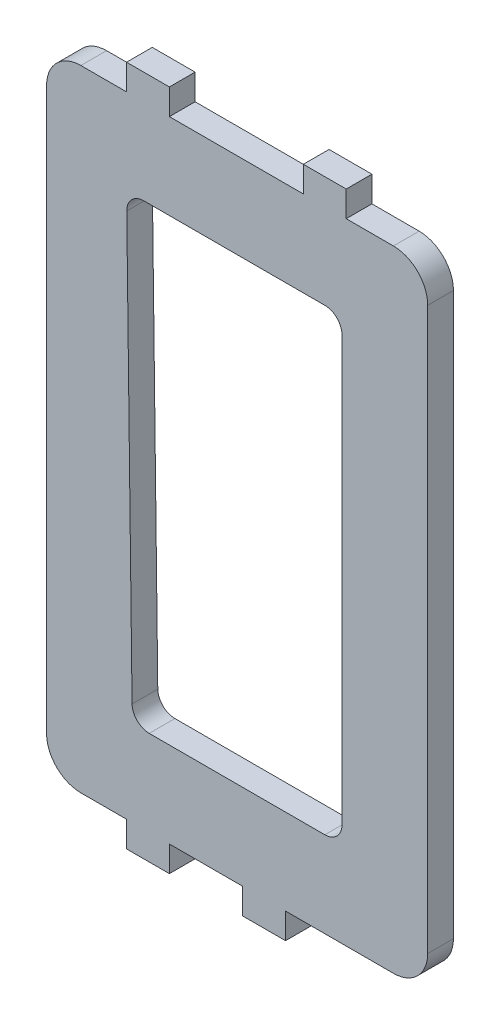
ISO-10303-21;
HEADER;
FILE_DESCRIPTION(('STEP AP214'),'2;1');
FILE_NAME('part.step','',(''),(''),'','','');
FILE_SCHEMA(('AUTOMOTIVE_DESIGN { 1 0 10303 214 1 1 1 1 }'));
ENDSEC;
DATA;
#1=APPLICATION_CONTEXT('core data for automotive mechanical design processes');
#2=APPLICATION_PROTOCOL_DEFINITION('international standard','automotive_design',2000,#1);
#3=PRODUCT_CONTEXT('',#1,'mechanical');
#4=PRODUCT('Part','Part','',(#3));
#5=PRODUCT_RELATED_PRODUCT_CATEGORY('part','',(#4));
#6=PRODUCT_DEFINITION_FORMATION('','',#4);
#7=PRODUCT_DEFINITION_CONTEXT('part definition',#1,'design');
#8=PRODUCT_DEFINITION('design','',#6,#7);
#9=PRODUCT_DEFINITION_SHAPE('','',#8);
#10=(LENGTH_UNIT() NAMED_UNIT(*) SI_UNIT(.MILLI.,.METRE.));
#11=(NAMED_UNIT(*) PLANE_ANGLE_UNIT() SI_UNIT($,.RADIAN.));
#12=(NAMED_UNIT(*) SI_UNIT($,.STERADIAN.) SOLID_ANGLE_UNIT());
#13=UNCERTAINTY_MEASURE_WITH_UNIT(LENGTH_MEASURE(1.E-05),#10,'distance_accuracy_value','');
#14=(GEOMETRIC_REPRESENTATION_CONTEXT(3) GLOBAL_UNCERTAINTY_ASSIGNED_CONTEXT((#13)) GLOBAL_UNIT_ASSIGNED_CONTEXT((#10,
#11,#12)) REPRESENTATION_CONTEXT('',''));
#15=CARTESIAN_POINT('',(0.,0.,0.));
#16=DIRECTION('',(0.,0.,1.));
#17=DIRECTION('',(1.,0.,0.));
#18=AXIS2_PLACEMENT_3D('',#15,#16,#17);
#19=CARTESIAN_POINT('',(-53.6952118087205,-16.8541333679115,3.));
#20=DIRECTION('',(0.,0.,-1.));
#21=DIRECTION('',(-1.,0.,0.));
#22=AXIS2_PLACEMENT_3D('',#19,#20,#21);
#23=PLANE('',#22);
#24=DIRECTION('',(1.,0.,0.));
#25=VECTOR('',#24,1.);
#26=CARTESIAN_POINT('',(-48.3652118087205,-20.8541333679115,3.));
#27=LINE('',#26,#25);
#28=CARTESIAN_POINT('',(-53.6952118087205,-20.8541333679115,3.));
#29=VERTEX_POINT('',#28);
#30=CARTESIAN_POINT('',(-48.3652118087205,-20.8541333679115,3.));
#31=VERTEX_POINT('',#30);
#32=EDGE_CURVE('E306',#29,#31,#27,.T.);
#33=ORIENTED_EDGE('',*,*,#32,.T.);
#34=DIRECTION('',(0.,-1.,0.));
#35=VECTOR('',#34,1.);
#36=CARTESIAN_POINT('',(-48.3652118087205,-20.8541333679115,3.));
#37=LINE('',#36,#35);
#38=CARTESIAN_POINT('',(-48.3652118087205,-23.8541333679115,3.));
#39=VERTEX_POINT('',#38);
#40=EDGE_CURVE('E309',#31,#39,#37,.T.);
#41=ORIENTED_EDGE('',*,*,#40,.T.);
#42=DIRECTION('',(1.,0.,0.));
#43=VECTOR('',#42,1.);
#44=CARTESIAN_POINT('',(-48.3652118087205,-23.8541333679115,3.));
#45=LINE('',#44,#43);
#46=CARTESIAN_POINT('',(-43.3652118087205,-23.8541333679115,3.));
#47=VERTEX_POINT('',#46);
#48=EDGE_CURVE('E312',#39,#47,#45,.T.);
#49=ORIENTED_EDGE('',*,*,#48,.T.);
#50=DIRECTION('',(0.,1.,0.));
#51=VECTOR('',#50,1.);
#52=CARTESIAN_POINT('',(-43.3652118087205,-23.8541333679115,3.));
#53=LINE('',#52,#51);
#54=CARTESIAN_POINT('',(-43.3652118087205,-20.8541333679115,3.));
#55=VERTEX_POINT('',#54);
#56=EDGE_CURVE('E314',#47,#55,#53,.T.);
#57=ORIENTED_EDGE('',*,*,#56,.T.);
#58=DIRECTION('',(1.,0.,0.));
#59=VECTOR('',#58,1.);
#60=CARTESIAN_POINT('',(-34.8152118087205,-20.8541333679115,3.));
#61=LINE('',#60,#59);
#62=CARTESIAN_POINT('',(-34.8152118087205,-20.8541333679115,3.));
#63=VERTEX_POINT('',#62);
#64=EDGE_CURVE('E316',#55,#63,#61,.T.);
#65=ORIENTED_EDGE('',*,*,#64,.T.);
#66=DIRECTION('',(0.,-1.,0.));
#67=VECTOR('',#66,1.);
#68=CARTESIAN_POINT('',(-34.8152118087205,-23.8541333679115,3.));
#69=LINE('',#68,#67);
#70=CARTESIAN_POINT('',(-34.8152118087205,-23.8541333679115,3.));
#71=VERTEX_POINT('',#70);
#72=EDGE_CURVE('E318',#63,#71,#69,.T.);
#73=ORIENTED_EDGE('',*,*,#72,.T.);
#74=DIRECTION('',(1.,0.,0.));
#75=VECTOR('',#74,1.);
#76=CARTESIAN_POINT('',(-34.8152118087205,-23.8541333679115,3.));
#77=LINE('',#76,#75);
#78=CARTESIAN_POINT('',(-29.8152118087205,-23.8541333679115,3.));
#79=VERTEX_POINT('',#78);
#80=EDGE_CURVE('E320',#71,#79,#77,.T.);
#81=ORIENTED_EDGE('',*,*,#80,.T.);
#82=DIRECTION('',(0.,1.,0.));
#83=VECTOR('',#82,1.);
#84=CARTESIAN_POINT('',(-29.8152118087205,-23.8541333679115,3.));
#85=LINE('',#84,#83);
#86=CARTESIAN_POINT('',(-29.8152118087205,-20.8541333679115,3.));
#87=VERTEX_POINT('',#86);
#88=EDGE_CURVE('E322',#79,#87,#85,.T.);
#89=ORIENTED_EDGE('',*,*,#88,.T.);
#90=DIRECTION('',(1.,0.,0.));
#91=VECTOR('',#90,1.);
#92=CARTESIAN_POINT('',(-29.8152118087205,-20.8541333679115,3.));
#93=LINE('',#92,#91);
#94=CARTESIAN_POINT('',(-17.2252118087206,-20.8541333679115,3.));
#95=VERTEX_POINT('',#94);
#96=EDGE_CURVE('E324',#87,#95,#93,.T.);
#97=ORIENTED_EDGE('',*,*,#96,.T.);
#98=CARTESIAN_POINT('',(-17.2252118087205,-16.8541333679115,3.));
#99=DIRECTION('',(0.,0.,1.));
#100=DIRECTION('',(-1.,0.,0.));
#101=AXIS2_PLACEMENT_3D('',#98,#99,#100);
#102=CIRCLE('',#101,4.);
#103=CARTESIAN_POINT('',(-13.2252118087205,-16.8541333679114,3.));
#104=VERTEX_POINT('',#103);
#105=EDGE_CURVE('E326',#95,#104,#102,.T.);
#106=ORIENTED_EDGE('',*,*,#105,.T.);
#107=DIRECTION('',(0.,1.,0.));
#108=VECTOR('',#107,1.);
#109=CARTESIAN_POINT('',(-13.2252118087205,48.6458666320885,3.));
#110=LINE('',#109,#108);
#111=CARTESIAN_POINT('',(-13.2252118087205,48.6458666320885,3.));
#112=VERTEX_POINT('',#111);
#113=EDGE_CURVE('E328',#104,#112,#110,.T.);
#114=ORIENTED_EDGE('',*,*,#113,.T.);
#115=CARTESIAN_POINT('',(-17.2252118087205,48.6458666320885,3.));
#116=DIRECTION('',(0.,0.,1.));
#117=DIRECTION('',(-1.,0.,0.));
#118=AXIS2_PLACEMENT_3D('',#115,#116,#117);
#119=CIRCLE('',#118,4.);
#120=CARTESIAN_POINT('',(-17.2252118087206,52.6458666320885,3.));
#121=VERTEX_POINT('',#120);
#122=EDGE_CURVE('E330',#112,#121,#119,.T.);
#123=ORIENTED_EDGE('',*,*,#122,.T.);
#124=DIRECTION('',(-1.,0.,0.));
#125=VECTOR('',#124,1.);
#126=CARTESIAN_POINT('',(-22.7352118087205,52.6458666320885,3.));
#127=LINE('',#126,#125);
#128=CARTESIAN_POINT('',(-22.7352118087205,52.6458666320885,3.));
#129=VERTEX_POINT('',#128);
#130=EDGE_CURVE('E332',#121,#129,#127,.T.);
#131=ORIENTED_EDGE('',*,*,#130,.T.);
#132=DIRECTION('',(0.,1.,0.));
#133=VECTOR('',#132,1.);
#134=CARTESIAN_POINT('',(-22.7352118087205,55.6458666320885,3.));
#135=LINE('',#134,#133);
#136=CARTESIAN_POINT('',(-22.7352118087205,55.6458666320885,3.));
#137=VERTEX_POINT('',#136);
#138=EDGE_CURVE('E334',#129,#137,#135,.T.);
#139=ORIENTED_EDGE('',*,*,#138,.T.);
#140=DIRECTION('',(-1.,0.,0.));
#141=VECTOR('',#140,1.);
#142=CARTESIAN_POINT('',(-27.7352118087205,55.6458666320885,3.));
#143=LINE('',#142,#141);
#144=CARTESIAN_POINT('',(-27.7352118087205,55.6458666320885,3.));
#145=VERTEX_POINT('',#144);
#146=EDGE_CURVE('E336',#137,#145,#143,.T.);
#147=ORIENTED_EDGE('',*,*,#146,.T.);
#148=DIRECTION('',(0.,-1.,0.));
#149=VECTOR('',#148,1.);
#150=CARTESIAN_POINT('',(-27.7352118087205,55.6458666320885,3.));
#151=LINE('',#150,#149);
#152=CARTESIAN_POINT('',(-27.7352118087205,52.6458666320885,3.));
#153=VERTEX_POINT('',#152);
#154=EDGE_CURVE('E338',#145,#153,#151,.T.);
#155=ORIENTED_EDGE('',*,*,#154,.T.);
#156=DIRECTION('',(-1.,0.,0.));
#157=VECTOR('',#156,1.);
#158=CARTESIAN_POINT('',(-27.7352118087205,52.6458666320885,3.));
#159=LINE('',#158,#157);
#160=CARTESIAN_POINT('',(-43.3652118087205,52.6458666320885,3.));
#161=VERTEX_POINT('',#160);
#162=EDGE_CURVE('E340',#153,#161,#159,.T.);
#163=ORIENTED_EDGE('',*,*,#162,.T.);
#164=DIRECTION('',(0.,1.,0.));
#165=VECTOR('',#164,1.);
#166=CARTESIAN_POINT('',(-43.3652118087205,55.6458666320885,3.));
#167=LINE('',#166,#165);
#168=CARTESIAN_POINT('',(-43.3652118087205,55.6458666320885,3.));
#169=VERTEX_POINT('',#168);
#170=EDGE_CURVE('E342',#161,#169,#167,.T.);
#171=ORIENTED_EDGE('',*,*,#170,.T.);
#172=DIRECTION('',(-1.,0.,0.));
#173=VECTOR('',#172,1.);
#174=CARTESIAN_POINT('',(-48.3652118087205,55.6458666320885,3.));
#175=LINE('',#174,#173);
#176=CARTESIAN_POINT('',(-48.3652118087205,55.6458666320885,3.));
#177=VERTEX_POINT('',#176);
#178=EDGE_CURVE('E344',#169,#177,#175,.T.);
#179=ORIENTED_EDGE('',*,*,#178,.T.);
#180=DIRECTION('',(0.,-1.,0.));
#181=VECTOR('',#180,1.);
#182=CARTESIAN_POINT('',(-48.3652118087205,52.6458666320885,3.));
#183=LINE('',#182,#181);
#184=CARTESIAN_POINT('',(-48.3652118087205,52.6458666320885,3.));
#185=VERTEX_POINT('',#184);
#186=EDGE_CURVE('E346',#177,#185,#183,.T.);
#187=ORIENTED_EDGE('',*,*,#186,.T.);
#188=DIRECTION('',(-1.,0.,0.));
#189=VECTOR('',#188,1.);
#190=CARTESIAN_POINT('',(-53.6952118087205,52.6458666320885,3.));
#191=LINE('',#190,#189);
#192=CARTESIAN_POINT('',(-53.6952118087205,52.6458666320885,3.));
#193=VERTEX_POINT('',#192);
#194=EDGE_CURVE('E348',#185,#193,#191,.T.);
#195=ORIENTED_EDGE('',*,*,#194,.T.);
#196=CARTESIAN_POINT('',(-53.6952118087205,48.6458666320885,3.));
#197=DIRECTION('',(0.,0.,1.));
#198=DIRECTION('',(-1.,0.,0.));
#199=AXIS2_PLACEMENT_3D('',#196,#197,#198);
#200=CIRCLE('',#199,4.);
#201=CARTESIAN_POINT('',(-57.6952118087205,48.6458666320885,3.));
#202=VERTEX_POINT('',#201);
#203=EDGE_CURVE('E350',#193,#202,#200,.T.);
#204=ORIENTED_EDGE('',*,*,#203,.T.);
#205=DIRECTION('',(0.,-1.,0.));
#206=VECTOR('',#205,1.);
#207=CARTESIAN_POINT('',(-57.6952118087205,48.6458666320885,3.));
#208=LINE('',#207,#206);
#209=CARTESIAN_POINT('',(-57.6952118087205,-16.8541333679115,3.));
#210=VERTEX_POINT('',#209);
#211=EDGE_CURVE('E352',#202,#210,#208,.T.);
#212=ORIENTED_EDGE('',*,*,#211,.T.);
#213=CARTESIAN_POINT('',(-53.6952118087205,-16.8541333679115,3.));
#214=DIRECTION('',(0.,0.,1.));
#215=DIRECTION('',(-1.,0.,0.));
#216=AXIS2_PLACEMENT_3D('',#213,#214,#215);
#217=CIRCLE('',#216,4.);
#218=EDGE_CURVE('E354',#210,#29,#217,.T.);
#219=ORIENTED_EDGE('',*,*,#218,.T.);
#220=EDGE_LOOP('',(#33,#41,#49,#57,#65,#73,#81,#89,#97,#106,#114,#123,#131,#139,#147,#155,#163,
#171,#179,#187,#195,#204,#212,#219));
#221=FACE_BOUND('',#220,.T.);
#222=CARTESIAN_POINT('',(-46.3400082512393,40.6458666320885,3.));
#223=DIRECTION('',(0.,0.,1.));
#224=DIRECTION('',(-1.,0.,0.));
#225=AXIS2_PLACEMENT_3D('',#222,#223,#224);
#226=CIRCLE('',#225,2.);
#227=CARTESIAN_POINT('',(-46.3400082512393,42.6458666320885,3.));
#228=VERTEX_POINT('',#227);
#229=CARTESIAN_POINT('',(-48.3398514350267,40.6208218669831,3.));
#230=VERTEX_POINT('',#229);
#231=EDGE_CURVE('E246',#228,#230,#226,.T.);
#232=ORIENTED_EDGE('',*,*,#231,.F.);
#233=DIRECTION('',(-1.,0.,0.));
#234=VECTOR('',#233,1.);
#235=CARTESIAN_POINT('',(-46.3400082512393,42.6458666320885,3.));
#236=LINE('',#235,#234);
#237=CARTESIAN_POINT('',(-25.2252118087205,42.6458666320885,3.));
#238=VERTEX_POINT('',#237);
#239=EDGE_CURVE('E241',#238,#228,#236,.T.);
#240=ORIENTED_EDGE('',*,*,#239,.F.);
#241=CARTESIAN_POINT('',(-25.2252118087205,40.6458666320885,3.));
#242=DIRECTION('',(0.,0.,1.));
#243=DIRECTION('',(-1.,0.,0.));
#244=AXIS2_PLACEMENT_3D('',#241,#242,#243);
#245=CIRCLE('',#244,2.);
#246=CARTESIAN_POINT('',(-23.2252118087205,40.6458666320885,3.));
#247=VERTEX_POINT('',#246);
#248=EDGE_CURVE('E272',#247,#238,#245,.T.);
#249=ORIENTED_EDGE('',*,*,#248,.F.);
#250=DIRECTION('',(0.,1.,0.));
#251=VECTOR('',#250,1.);
#252=CARTESIAN_POINT('',(-23.2252118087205,40.6458666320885,3.));
#253=LINE('',#252,#251);
#254=CARTESIAN_POINT('',(-23.2252118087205,-8.85413336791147,3.));
#255=VERTEX_POINT('',#254);
#256=EDGE_CURVE('E270',#255,#247,#253,.T.);
#257=ORIENTED_EDGE('',*,*,#256,.F.);
#258=CARTESIAN_POINT('',(-25.2252118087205,-8.85413336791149,3.));
#259=DIRECTION('',(0.,0.,1.));
#260=DIRECTION('',(-1.,0.,0.));
#261=AXIS2_PLACEMENT_3D('',#258,#259,#260);
#262=CIRCLE('',#261,2.);
#263=CARTESIAN_POINT('',(-25.2252118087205,-10.8541333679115,3.));
#264=VERTEX_POINT('',#263);
#265=EDGE_CURVE('E268',#264,#255,#262,.T.);
#266=ORIENTED_EDGE('',*,*,#265,.F.);
#267=DIRECTION('',(1.,0.,0.));
#268=VECTOR('',#267,1.);
#269=CARTESIAN_POINT('',(-25.2252118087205,-10.8541333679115,3.));
#270=LINE('',#269,#268);
#271=CARTESIAN_POINT('',(-45.7201017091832,-10.8541333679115,3.));
#272=VERTEX_POINT('',#271);
#273=EDGE_CURVE('E266',#272,#264,#270,.T.);
#274=ORIENTED_EDGE('',*,*,#273,.F.);
#275=CARTESIAN_POINT('',(-45.7201017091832,-8.85413336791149,3.));
#276=DIRECTION('',(0.,0.,1.));
#277=DIRECTION('',(-1.,0.,0.));
#278=AXIS2_PLACEMENT_3D('',#275,#276,#277);
#279=CIRCLE('',#278,2.);
#280=CARTESIAN_POINT('',(-47.7199448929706,-8.87917813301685,3.));
#281=VERTEX_POINT('',#280);
#282=EDGE_CURVE('E262',#281,#272,#279,.T.);
#283=ORIENTED_EDGE('',*,*,#282,.F.);
#284=DIRECTION('',(0.0125223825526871,-0.999921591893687,0.));
#285=VECTOR('',#284,1.);
#286=CARTESIAN_POINT('',(-47.7199448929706,-8.87917813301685,3.));
#287=LINE('',#286,#285);
#288=EDGE_CURVE('E260',#230,#281,#287,.T.);
#289=ORIENTED_EDGE('',*,*,#288,.F.);
#290=EDGE_LOOP('',(#232,#240,#249,#257,#266,#274,#283,#289));
#291=FACE_BOUND('',#290,.T.);
#292=ADVANCED_FACE('F35',(#221,#291),#23,.F.);
#293=CARTESIAN_POINT('',(-53.6952118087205,-16.8541333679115,0.));
#294=DIRECTION('',(0.,0.,-1.));
#295=DIRECTION('',(-1.,0.,0.));
#296=AXIS2_PLACEMENT_3D('',#293,#294,#295);
#297=PLANE('',#296);
#298=DIRECTION('',(1.,0.,0.));
#299=VECTOR('',#298,1.);
#300=CARTESIAN_POINT('',(-48.3652118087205,-20.8541333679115,0.));
#301=LINE('',#300,#299);
#302=CARTESIAN_POINT('',(-53.6952118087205,-20.8541333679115,0.));
#303=VERTEX_POINT('',#302);
#304=CARTESIAN_POINT('',(-48.3652118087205,-20.8541333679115,0.));
#305=VERTEX_POINT('',#304);
#306=EDGE_CURVE('E255',#303,#305,#301,.T.);
#307=ORIENTED_EDGE('',*,*,#306,.F.);
#308=CARTESIAN_POINT('',(-53.6952118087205,-16.8541333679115,0.));
#309=DIRECTION('',(0.,0.,1.));
#310=DIRECTION('',(-1.,0.,0.));
#311=AXIS2_PLACEMENT_3D('',#308,#309,#310);
#312=CIRCLE('',#311,4.);
#313=CARTESIAN_POINT('',(-57.6952118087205,-16.8541333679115,0.));
#314=VERTEX_POINT('',#313);
#315=EDGE_CURVE('E310',#314,#303,#312,.T.);
#316=ORIENTED_EDGE('',*,*,#315,.F.);
#317=DIRECTION('',(0.,-1.,0.));
#318=VECTOR('',#317,1.);
#319=CARTESIAN_POINT('',(-57.6952118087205,48.6458666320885,0.));
#320=LINE('',#319,#318);
#321=CARTESIAN_POINT('',(-57.6952118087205,48.6458666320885,0.));
#322=VERTEX_POINT('',#321);
#323=EDGE_CURVE('E401',#322,#314,#320,.T.);
#324=ORIENTED_EDGE('',*,*,#323,.F.);
#325=CARTESIAN_POINT('',(-53.6952118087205,48.6458666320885,0.));
#326=DIRECTION('',(0.,0.,1.));
#327=DIRECTION('',(-1.,0.,0.));
#328=AXIS2_PLACEMENT_3D('',#325,#326,#327);
#329=CIRCLE('',#328,4.);
#330=CARTESIAN_POINT('',(-53.6952118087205,52.6458666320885,0.));
#331=VERTEX_POINT('',#330);
#332=EDGE_CURVE('E399',#331,#322,#329,.T.);
#333=ORIENTED_EDGE('',*,*,#332,.F.);
#334=DIRECTION('',(-1.,0.,0.));
#335=VECTOR('',#334,1.);
#336=CARTESIAN_POINT('',(-53.6952118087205,52.6458666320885,0.));
#337=LINE('',#336,#335);
#338=CARTESIAN_POINT('',(-48.3652118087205,52.6458666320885,0.));
#339=VERTEX_POINT('',#338);
#340=EDGE_CURVE('E397',#339,#331,#337,.T.);
#341=ORIENTED_EDGE('',*,*,#340,.F.);
#342=DIRECTION('',(0.,-1.,0.));
#343=VECTOR('',#342,1.);
#344=CARTESIAN_POINT('',(-48.3652118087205,52.6458666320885,0.));
#345=LINE('',#344,#343);
#346=CARTESIAN_POINT('',(-48.3652118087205,55.6458666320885,0.));
#347=VERTEX_POINT('',#346);
#348=EDGE_CURVE('E395',#347,#339,#345,.T.);
#349=ORIENTED_EDGE('',*,*,#348,.F.);
#350=DIRECTION('',(-1.,0.,0.));
#351=VECTOR('',#350,1.);
#352=CARTESIAN_POINT('',(-48.3652118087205,55.6458666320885,0.));
#353=LINE('',#352,#351);
#354=CARTESIAN_POINT('',(-43.3652118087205,55.6458666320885,0.));
#355=VERTEX_POINT('',#354);
#356=EDGE_CURVE('E393',#355,#347,#353,.T.);
#357=ORIENTED_EDGE('',*,*,#356,.F.);
#358=DIRECTION('',(0.,1.,0.));
#359=VECTOR('',#358,1.);
#360=CARTESIAN_POINT('',(-43.3652118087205,55.6458666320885,0.));
#361=LINE('',#360,#359);
#362=CARTESIAN_POINT('',(-43.3652118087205,52.6458666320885,0.));
#363=VERTEX_POINT('',#362);
#364=EDGE_CURVE('E391',#363,#355,#361,.T.);
#365=ORIENTED_EDGE('',*,*,#364,.F.);
#366=DIRECTION('',(-1.,0.,0.));
#367=VECTOR('',#366,1.);
#368=CARTESIAN_POINT('',(-27.7352118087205,52.6458666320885,0.));
#369=LINE('',#368,#367);
#370=CARTESIAN_POINT('',(-27.7352118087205,52.6458666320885,0.));
#371=VERTEX_POINT('',#370);
#372=EDGE_CURVE('E389',#371,#363,#369,.T.);
#373=ORIENTED_EDGE('',*,*,#372,.F.);
#374=DIRECTION('',(0.,-1.,0.));
#375=VECTOR('',#374,1.);
#376=CARTESIAN_POINT('',(-27.7352118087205,55.6458666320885,0.));
#377=LINE('',#376,#375);
#378=CARTESIAN_POINT('',(-27.7352118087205,55.6458666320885,0.));
#379=VERTEX_POINT('',#378);
#380=EDGE_CURVE('E387',#379,#371,#377,.T.);
#381=ORIENTED_EDGE('',*,*,#380,.F.);
#382=DIRECTION('',(-1.,0.,0.));
#383=VECTOR('',#382,1.);
#384=CARTESIAN_POINT('',(-27.7352118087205,55.6458666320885,0.));
#385=LINE('',#384,#383);
#386=CARTESIAN_POINT('',(-22.7352118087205,55.6458666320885,0.));
#387=VERTEX_POINT('',#386);
#388=EDGE_CURVE('E385',#387,#379,#385,.T.);
#389=ORIENTED_EDGE('',*,*,#388,.F.);
#390=DIRECTION('',(0.,1.,0.));
#391=VECTOR('',#390,1.);
#392=CARTESIAN_POINT('',(-22.7352118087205,55.6458666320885,0.));
#393=LINE('',#392,#391);
#394=CARTESIAN_POINT('',(-22.7352118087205,52.6458666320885,0.));
#395=VERTEX_POINT('',#394);
#396=EDGE_CURVE('E383',#395,#387,#393,.T.);
#397=ORIENTED_EDGE('',*,*,#396,.F.);
#398=DIRECTION('',(-1.,0.,0.));
#399=VECTOR('',#398,1.);
#400=CARTESIAN_POINT('',(-22.7352118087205,52.6458666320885,0.));
#401=LINE('',#400,#399);
#402=CARTESIAN_POINT('',(-17.2252118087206,52.6458666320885,0.));
#403=VERTEX_POINT('',#402);
#404=EDGE_CURVE('E381',#403,#395,#401,.T.);
#405=ORIENTED_EDGE('',*,*,#404,.F.);
#406=CARTESIAN_POINT('',(-17.2252118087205,48.6458666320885,0.));
#407=DIRECTION('',(0.,0.,1.));
#408=DIRECTION('',(-1.,0.,0.));
#409=AXIS2_PLACEMENT_3D('',#406,#407,#408);
#410=CIRCLE('',#409,4.);
#411=CARTESIAN_POINT('',(-13.2252118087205,48.6458666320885,0.));
#412=VERTEX_POINT('',#411);
#413=EDGE_CURVE('E379',#412,#403,#410,.T.);
#414=ORIENTED_EDGE('',*,*,#413,.F.);
#415=DIRECTION('',(0.,1.,0.));
#416=VECTOR('',#415,1.);
#417=CARTESIAN_POINT('',(-13.2252118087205,48.6458666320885,0.));
#418=LINE('',#417,#416);
#419=CARTESIAN_POINT('',(-13.2252118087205,-16.8541333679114,0.));
#420=VERTEX_POINT('',#419);
#421=EDGE_CURVE('E377',#420,#412,#418,.T.);
#422=ORIENTED_EDGE('',*,*,#421,.F.);
#423=CARTESIAN_POINT('',(-17.2252118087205,-16.8541333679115,0.));
#424=DIRECTION('',(0.,0.,1.));
#425=DIRECTION('',(-1.,0.,0.));
#426=AXIS2_PLACEMENT_3D('',#423,#424,#425);
#427=CIRCLE('',#426,4.);
#428=CARTESIAN_POINT('',(-17.2252118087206,-20.8541333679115,0.));
#429=VERTEX_POINT('',#428);
#430=EDGE_CURVE('E375',#429,#420,#427,.T.);
#431=ORIENTED_EDGE('',*,*,#430,.F.);
#432=DIRECTION('',(1.,0.,0.));
#433=VECTOR('',#432,1.);
#434=CARTESIAN_POINT('',(-29.8152118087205,-20.8541333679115,0.));
#435=LINE('',#434,#433);
#436=CARTESIAN_POINT('',(-29.8152118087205,-20.8541333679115,0.));
#437=VERTEX_POINT('',#436);
#438=EDGE_CURVE('E373',#437,#429,#435,.T.);
#439=ORIENTED_EDGE('',*,*,#438,.F.);
#440=DIRECTION('',(0.,1.,0.));
#441=VECTOR('',#440,1.);
#442=CARTESIAN_POINT('',(-29.8152118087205,-23.8541333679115,0.));
#443=LINE('',#442,#441);
#444=CARTESIAN_POINT('',(-29.8152118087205,-23.8541333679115,0.));
#445=VERTEX_POINT('',#444);
#446=EDGE_CURVE('E371',#445,#437,#443,.T.);
#447=ORIENTED_EDGE('',*,*,#446,.F.);
#448=DIRECTION('',(1.,0.,0.));
#449=VECTOR('',#448,1.);
#450=CARTESIAN_POINT('',(-34.8152118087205,-23.8541333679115,0.));
#451=LINE('',#450,#449);
#452=CARTESIAN_POINT('',(-34.8152118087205,-23.8541333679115,0.));
#453=VERTEX_POINT('',#452);
#454=EDGE_CURVE('E369',#453,#445,#451,.T.);
#455=ORIENTED_EDGE('',*,*,#454,.F.);
#456=DIRECTION('',(0.,-1.,0.));
#457=VECTOR('',#456,1.);
#458=CARTESIAN_POINT('',(-34.8152118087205,-23.8541333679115,0.));
#459=LINE('',#458,#457);
#460=CARTESIAN_POINT('',(-34.8152118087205,-20.8541333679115,0.));
#461=VERTEX_POINT('',#460);
#462=EDGE_CURVE('E367',#461,#453,#459,.T.);
#463=ORIENTED_EDGE('',*,*,#462,.F.);
#464=DIRECTION('',(1.,0.,0.));
#465=VECTOR('',#464,1.);
#466=CARTESIAN_POINT('',(-34.8152118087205,-20.8541333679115,0.));
#467=LINE('',#466,#465);
#468=CARTESIAN_POINT('',(-43.3652118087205,-20.8541333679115,0.));
#469=VERTEX_POINT('',#468);
#470=EDGE_CURVE('E365',#469,#461,#467,.T.);
#471=ORIENTED_EDGE('',*,*,#470,.F.);
#472=DIRECTION('',(0.,1.,0.));
#473=VECTOR('',#472,1.);
#474=CARTESIAN_POINT('',(-43.3652118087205,-23.8541333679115,0.));
#475=LINE('',#474,#473);
#476=CARTESIAN_POINT('',(-43.3652118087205,-23.8541333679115,0.));
#477=VERTEX_POINT('',#476);
#478=EDGE_CURVE('E363',#477,#469,#475,.T.);
#479=ORIENTED_EDGE('',*,*,#478,.F.);
#480=DIRECTION('',(1.,0.,0.));
#481=VECTOR('',#480,1.);
#482=CARTESIAN_POINT('',(-48.3652118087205,-23.8541333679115,0.));
#483=LINE('',#482,#481);
#484=CARTESIAN_POINT('',(-48.3652118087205,-23.8541333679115,0.));
#485=VERTEX_POINT('',#484);
#486=EDGE_CURVE('E361',#485,#477,#483,.T.);
#487=ORIENTED_EDGE('',*,*,#486,.F.);
#488=DIRECTION('',(0.,-1.,0.));
#489=VECTOR('',#488,1.);
#490=CARTESIAN_POINT('',(-48.3652118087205,-20.8541333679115,0.));
#491=LINE('',#490,#489);
#492=EDGE_CURVE('E359',#305,#485,#491,.T.);
#493=ORIENTED_EDGE('',*,*,#492,.F.);
#494=EDGE_LOOP('',(#307,#316,#324,#333,#341,#349,#357,#365,#373,#381,#389,#397,#405,#414,#422,
#431,#439,#447,#455,#463,#471,#479,#487,#493));
#495=FACE_BOUND('',#494,.T.);
#496=DIRECTION('',(-1.,0.,0.));
#497=VECTOR('',#496,1.);
#498=CARTESIAN_POINT('',(-35.5502118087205,42.6458666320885,0.));
#499=LINE('',#498,#497);
#500=CARTESIAN_POINT('',(-25.2252118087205,42.6458666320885,0.));
#501=VERTEX_POINT('',#500);
#502=CARTESIAN_POINT('',(-46.3400082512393,42.6458666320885,0.));
#503=VERTEX_POINT('',#502);
#504=EDGE_CURVE('E247',#501,#503,#499,.T.);
#505=ORIENTED_EDGE('',*,*,#504,.T.);
#506=CARTESIAN_POINT('',(-46.3400082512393,40.6458666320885,0.));
#507=DIRECTION('',(0.,0.,1.));
#508=DIRECTION('',(-1.,0.,0.));
#509=AXIS2_PLACEMENT_3D('',#506,#507,#508);
#510=CIRCLE('',#509,2.);
#511=CARTESIAN_POINT('',(-48.3398514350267,40.6208218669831,0.));
#512=VERTEX_POINT('',#511);
#513=EDGE_CURVE('E253',#503,#512,#510,.T.);
#514=ORIENTED_EDGE('',*,*,#513,.T.);
#515=DIRECTION('',(0.0125223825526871,-0.999921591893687,0.));
#516=VECTOR('',#515,1.);
#517=CARTESIAN_POINT('',(-47.7199448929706,-8.87917813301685,0.));
#518=LINE('',#517,#516);
#519=CARTESIAN_POINT('',(-47.7199448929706,-8.87917813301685,0.));
#520=VERTEX_POINT('',#519);
#521=EDGE_CURVE('E275',#512,#520,#518,.T.);
#522=ORIENTED_EDGE('',*,*,#521,.T.);
#523=CARTESIAN_POINT('',(-45.7201017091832,-8.85413336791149,0.));
#524=DIRECTION('',(0.,0.,1.));
#525=DIRECTION('',(-1.,0.,0.));
#526=AXIS2_PLACEMENT_3D('',#523,#524,#525);
#527=CIRCLE('',#526,2.);
#528=CARTESIAN_POINT('',(-45.7201017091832,-10.8541333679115,0.));
#529=VERTEX_POINT('',#528);
#530=EDGE_CURVE('E278',#520,#529,#527,.T.);
#531=ORIENTED_EDGE('',*,*,#530,.T.);
#532=DIRECTION('',(1.,0.,0.));
#533=VECTOR('',#532,1.);
#534=CARTESIAN_POINT('',(-25.2252118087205,-10.8541333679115,0.));
#535=LINE('',#534,#533);
#536=CARTESIAN_POINT('',(-25.2252118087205,-10.8541333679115,0.));
#537=VERTEX_POINT('',#536);
#538=EDGE_CURVE('E281',#529,#537,#535,.T.);
#539=ORIENTED_EDGE('',*,*,#538,.T.);
#540=CARTESIAN_POINT('',(-25.2252118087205,-8.85413336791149,0.));
#541=DIRECTION('',(0.,0.,1.));
#542=DIRECTION('',(-1.,0.,0.));
#543=AXIS2_PLACEMENT_3D('',#540,#541,#542);
#544=CIRCLE('',#543,2.);
#545=CARTESIAN_POINT('',(-23.2252118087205,-8.85413336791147,0.));
#546=VERTEX_POINT('',#545);
#547=EDGE_CURVE('E284',#537,#546,#544,.T.);
#548=ORIENTED_EDGE('',*,*,#547,.T.);
#549=DIRECTION('',(0.,1.,0.));
#550=VECTOR('',#549,1.);
#551=CARTESIAN_POINT('',(-23.2252118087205,40.6458666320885,0.));
#552=LINE('',#551,#550);
#553=CARTESIAN_POINT('',(-23.2252118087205,40.6458666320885,0.));
#554=VERTEX_POINT('',#553);
#555=EDGE_CURVE('E287',#546,#554,#552,.T.);
#556=ORIENTED_EDGE('',*,*,#555,.T.);
#557=CARTESIAN_POINT('',(-25.2252118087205,40.6458666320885,0.));
#558=DIRECTION('',(0.,0.,1.));
#559=DIRECTION('',(-1.,0.,0.));
#560=AXIS2_PLACEMENT_3D('',#557,#558,#559);
#561=CIRCLE('',#560,2.);
#562=EDGE_CURVE('E290',#554,#501,#561,.T.);
#563=ORIENTED_EDGE('',*,*,#562,.T.);
#564=EDGE_LOOP('',(#505,#514,#522,#531,#539,#548,#556,#563));
#565=FACE_BOUND('',#564,.T.);
#566=ADVANCED_FACE('F479',(#495,#565),#297,.T.);
#567=CARTESIAN_POINT('',(-48.3652118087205,-20.8541333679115,3.));
#568=DIRECTION('',(0.,1.,0.));
#569=DIRECTION('',(-1.,0.,0.));
#570=AXIS2_PLACEMENT_3D('',#567,#568,#569);
#571=PLANE('',#570);
#572=ORIENTED_EDGE('',*,*,#306,.T.);
#573=DIRECTION('',(0.,0.,-1.));
#574=VECTOR('',#573,1.);
#575=CARTESIAN_POINT('',(-48.3652118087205,-20.8541333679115,3.));
#576=LINE('',#575,#574);
#577=EDGE_CURVE('E11',#31,#305,#576,.T.);
#578=ORIENTED_EDGE('',*,*,#577,.F.);
#579=ORIENTED_EDGE('',*,*,#32,.F.);
#580=DIRECTION('',(0.,0.,-1.));
#581=VECTOR('',#580,1.);
#582=CARTESIAN_POINT('',(-53.6952118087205,-20.8541333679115,3.));
#583=LINE('',#582,#581);
#584=EDGE_CURVE('E356',#29,#303,#583,.T.);
#585=ORIENTED_EDGE('',*,*,#584,.T.);
#586=EDGE_LOOP('',(#572,#578,#579,#585));
#587=FACE_BOUND('',#586,.T.);
#588=ADVANCED_FACE('F37',(#587),#571,.F.);
#589=CARTESIAN_POINT('',(-48.3652118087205,-20.8541333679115,3.));
#590=DIRECTION('',(1.,0.,0.));
#591=DIRECTION('',(0.,0.,-1.));
#592=AXIS2_PLACEMENT_3D('',#589,#590,#591);
#593=PLANE('',#592);
#594=ORIENTED_EDGE('',*,*,#492,.T.);
#595=DIRECTION('',(0.,0.,-1.));
#596=VECTOR('',#595,1.);
#597=CARTESIAN_POINT('',(-48.3652118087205,-23.8541333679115,3.));
#598=LINE('',#597,#596);
#599=EDGE_CURVE('E43',#39,#485,#598,.T.);
#600=ORIENTED_EDGE('',*,*,#599,.F.);
#601=ORIENTED_EDGE('',*,*,#40,.F.);
#602=ORIENTED_EDGE('',*,*,#577,.T.);
#603=EDGE_LOOP('',(#594,#600,#601,#602));
#604=FACE_BOUND('',#603,.T.);
#605=ADVANCED_FACE('F496',(#604),#593,.F.);
#606=CARTESIAN_POINT('',(-48.3652118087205,-23.8541333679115,3.));
#607=DIRECTION('',(0.,1.,0.));
#608=DIRECTION('',(0.,0.,1.));
#609=AXIS2_PLACEMENT_3D('',#606,#607,#608);
#610=PLANE('',#609);
#611=ORIENTED_EDGE('',*,*,#486,.T.);
#612=DIRECTION('',(0.,0.,-1.));
#613=VECTOR('',#612,1.);
#614=CARTESIAN_POINT('',(-43.3652118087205,-23.8541333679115,3.));
#615=LINE('',#614,#613);
#616=EDGE_CURVE('E466',#47,#477,#615,.T.);
#617=ORIENTED_EDGE('',*,*,#616,.F.);
#618=ORIENTED_EDGE('',*,*,#48,.F.);
#619=ORIENTED_EDGE('',*,*,#599,.T.);
#620=EDGE_LOOP('',(#611,#617,#618,#619));
#621=FACE_BOUND('',#620,.T.);
#622=ADVANCED_FACE('F473',(#621),#610,.F.);
#623=CARTESIAN_POINT('',(-43.3652118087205,-23.8541333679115,3.));
#624=DIRECTION('',(-1.,0.,0.));
#625=DIRECTION('',(0.,0.,1.));
#626=AXIS2_PLACEMENT_3D('',#623,#624,#625);
#627=PLANE('',#626);
#628=ORIENTED_EDGE('',*,*,#478,.T.);
#629=DIRECTION('',(0.,0.,-1.));
#630=VECTOR('',#629,1.);
#631=CARTESIAN_POINT('',(-43.3652118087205,-20.8541333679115,3.));
#632=LINE('',#631,#630);
#633=EDGE_CURVE('E463',#55,#469,#632,.T.);
#634=ORIENTED_EDGE('',*,*,#633,.F.);
#635=ORIENTED_EDGE('',*,*,#56,.F.);
#636=ORIENTED_EDGE('',*,*,#616,.T.);
#637=EDGE_LOOP('',(#628,#634,#635,#636));
#638=FACE_BOUND('',#637,.T.);
#639=ADVANCED_FACE('F485',(#638),#627,.F.);
#640=CARTESIAN_POINT('',(-34.8152118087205,-20.8541333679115,3.));
#641=DIRECTION('',(0.,1.,0.));
#642=DIRECTION('',(-1.,0.,0.));
#643=AXIS2_PLACEMENT_3D('',#640,#641,#642);
#644=PLANE('',#643);
#645=ORIENTED_EDGE('',*,*,#470,.T.);
#646=DIRECTION('',(0.,0.,-1.));
#647=VECTOR('',#646,1.);
#648=CARTESIAN_POINT('',(-34.8152118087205,-20.8541333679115,3.));
#649=LINE('',#648,#647);
#650=EDGE_CURVE('E460',#63,#461,#649,.T.);
#651=ORIENTED_EDGE('',*,*,#650,.F.);
#652=ORIENTED_EDGE('',*,*,#64,.F.);
#653=ORIENTED_EDGE('',*,*,#633,.T.);
#654=EDGE_LOOP('',(#645,#651,#652,#653));
#655=FACE_BOUND('',#654,.T.);
#656=ADVANCED_FACE('F489',(#655),#644,.F.);
#657=CARTESIAN_POINT('',(-34.8152118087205,-23.8541333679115,3.));
#658=DIRECTION('',(1.,0.,0.));
#659=DIRECTION('',(0.,1.,0.));
#660=AXIS2_PLACEMENT_3D('',#657,#658,#659);
#661=PLANE('',#660);
#662=ORIENTED_EDGE('',*,*,#462,.T.);
#663=DIRECTION('',(0.,0.,-1.));
#664=VECTOR('',#663,1.);
#665=CARTESIAN_POINT('',(-34.8152118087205,-23.8541333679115,3.));
#666=LINE('',#665,#664);
#667=EDGE_CURVE('E457',#71,#453,#666,.T.);
#668=ORIENTED_EDGE('',*,*,#667,.F.);
#669=ORIENTED_EDGE('',*,*,#72,.F.);
#670=ORIENTED_EDGE('',*,*,#650,.T.);
#671=EDGE_LOOP('',(#662,#668,#669,#670));
#672=FACE_BOUND('',#671,.T.);
#673=ADVANCED_FACE('F589',(#672),#661,.F.);
#674=CARTESIAN_POINT('',(-34.8152118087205,-23.8541333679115,3.));
#675=DIRECTION('',(0.,1.,0.));
#676=DIRECTION('',(-1.,0.,0.));
#677=AXIS2_PLACEMENT_3D('',#674,#675,#676);
#678=PLANE('',#677);
#679=ORIENTED_EDGE('',*,*,#454,.T.);
#680=DIRECTION('',(0.,0.,-1.));
#681=VECTOR('',#680,1.);
#682=CARTESIAN_POINT('',(-29.8152118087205,-23.8541333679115,3.));
#683=LINE('',#682,#681);
#684=EDGE_CURVE('E454',#79,#445,#683,.T.);
#685=ORIENTED_EDGE('',*,*,#684,.F.);
#686=ORIENTED_EDGE('',*,*,#80,.F.);
#687=ORIENTED_EDGE('',*,*,#667,.T.);
#688=EDGE_LOOP('',(#679,#685,#686,#687));
#689=FACE_BOUND('',#688,.T.);
#690=ADVANCED_FACE('F587',(#689),#678,.F.);
#691=CARTESIAN_POINT('',(-29.8152118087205,-23.8541333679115,3.));
#692=DIRECTION('',(-1.,0.,0.));
#693=DIRECTION('',(0.,-1.,0.));
#694=AXIS2_PLACEMENT_3D('',#691,#692,#693);
#695=PLANE('',#694);
#696=ORIENTED_EDGE('',*,*,#446,.T.);
#697=DIRECTION('',(0.,0.,-1.));
#698=VECTOR('',#697,1.);
#699=CARTESIAN_POINT('',(-29.8152118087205,-20.8541333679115,3.));
#700=LINE('',#699,#698);
#701=EDGE_CURVE('E451',#87,#437,#700,.T.);
#702=ORIENTED_EDGE('',*,*,#701,.F.);
#703=ORIENTED_EDGE('',*,*,#88,.F.);
#704=ORIENTED_EDGE('',*,*,#684,.T.);
#705=EDGE_LOOP('',(#696,#702,#703,#704));
#706=FACE_BOUND('',#705,.T.);
#707=ADVANCED_FACE('F583',(#706),#695,.F.);
#708=CARTESIAN_POINT('',(-29.8152118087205,-20.8541333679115,3.));
#709=DIRECTION('',(0.,1.,0.));
#710=DIRECTION('',(0.,0.,1.));
#711=AXIS2_PLACEMENT_3D('',#708,#709,#710);
#712=PLANE('',#711);
#713=ORIENTED_EDGE('',*,*,#438,.T.);
#714=DIRECTION('',(0.,0.,-1.));
#715=VECTOR('',#714,1.);
#716=CARTESIAN_POINT('',(-17.2252118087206,-20.8541333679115,3.));
#717=LINE('',#716,#715);
#718=EDGE_CURVE('E448',#95,#429,#717,.T.);
#719=ORIENTED_EDGE('',*,*,#718,.F.);
#720=ORIENTED_EDGE('',*,*,#96,.F.);
#721=ORIENTED_EDGE('',*,*,#701,.T.);
#722=EDGE_LOOP('',(#713,#719,#720,#721));
#723=FACE_BOUND('',#722,.T.);
#724=ADVANCED_FACE('F578',(#723),#712,.F.);
#725=CARTESIAN_POINT('',(-17.2252118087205,-16.8541333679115,3.));
#726=DIRECTION('',(0.,0.,-1.));
#727=DIRECTION('',(-1.,0.,0.));
#728=AXIS2_PLACEMENT_3D('',#725,#726,#727);
#729=CYLINDRICAL_SURFACE('',#728,4.);
#730=ORIENTED_EDGE('',*,*,#430,.T.);
#731=DIRECTION('',(0.,0.,-1.));
#732=VECTOR('',#731,1.);
#733=CARTESIAN_POINT('',(-13.2252118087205,-16.8541333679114,3.));
#734=LINE('',#733,#732);
#735=EDGE_CURVE('E445',#104,#420,#734,.T.);
#736=ORIENTED_EDGE('',*,*,#735,.F.);
#737=ORIENTED_EDGE('',*,*,#105,.F.);
#738=ORIENTED_EDGE('',*,*,#718,.T.);
#739=EDGE_LOOP('',(#730,#736,#737,#738));
#740=FACE_BOUND('',#739,.T.);
#741=ADVANCED_FACE('F572',(#740),#729,.T.);
#742=CARTESIAN_POINT('',(-13.2252118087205,48.6458666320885,3.));
#743=DIRECTION('',(-1.,0.,0.));
#744=DIRECTION('',(0.,-1.,0.));
#745=AXIS2_PLACEMENT_3D('',#742,#743,#744);
#746=PLANE('',#745);
#747=ORIENTED_EDGE('',*,*,#421,.T.);
#748=DIRECTION('',(0.,0.,-1.));
#749=VECTOR('',#748,1.);
#750=CARTESIAN_POINT('',(-13.2252118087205,48.6458666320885,3.));
#751=LINE('',#750,#749);
#752=EDGE_CURVE('E442',#112,#412,#751,.T.);
#753=ORIENTED_EDGE('',*,*,#752,.F.);
#754=ORIENTED_EDGE('',*,*,#113,.F.);
#755=ORIENTED_EDGE('',*,*,#735,.T.);
#756=EDGE_LOOP('',(#747,#753,#754,#755));
#757=FACE_BOUND('',#756,.T.);
#758=ADVANCED_FACE('F568',(#757),#746,.F.);
#759=CARTESIAN_POINT('',(-17.2252118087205,48.6458666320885,3.));
#760=DIRECTION('',(0.,0.,-1.));
#761=DIRECTION('',(-1.,0.,0.));
#762=AXIS2_PLACEMENT_3D('',#759,#760,#761);
#763=CYLINDRICAL_SURFACE('',#762,4.);
#764=ORIENTED_EDGE('',*,*,#413,.T.);
#765=DIRECTION('',(0.,0.,-1.));
#766=VECTOR('',#765,1.);
#767=CARTESIAN_POINT('',(-17.2252118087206,52.6458666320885,3.));
#768=LINE('',#767,#766);
#769=EDGE_CURVE('E439',#121,#403,#768,.T.);
#770=ORIENTED_EDGE('',*,*,#769,.F.);
#771=ORIENTED_EDGE('',*,*,#122,.F.);
#772=ORIENTED_EDGE('',*,*,#752,.T.);
#773=EDGE_LOOP('',(#764,#770,#771,#772));
#774=FACE_BOUND('',#773,.T.);
#775=ADVANCED_FACE('F563',(#774),#763,.T.);
#776=CARTESIAN_POINT('',(-22.7352118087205,52.6458666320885,3.));
#777=DIRECTION('',(0.,-1.,0.));
#778=DIRECTION('',(1.,0.,0.));
#779=AXIS2_PLACEMENT_3D('',#776,#777,#778);
#780=PLANE('',#779);
#781=ORIENTED_EDGE('',*,*,#404,.T.);
#782=DIRECTION('',(0.,0.,-1.));
#783=VECTOR('',#782,1.);
#784=CARTESIAN_POINT('',(-22.7352118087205,52.6458666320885,3.));
#785=LINE('',#784,#783);
#786=EDGE_CURVE('E436',#129,#395,#785,.T.);
#787=ORIENTED_EDGE('',*,*,#786,.F.);
#788=ORIENTED_EDGE('',*,*,#130,.F.);
#789=ORIENTED_EDGE('',*,*,#769,.T.);
#790=EDGE_LOOP('',(#781,#787,#788,#789));
#791=FACE_BOUND('',#790,.T.);
#792=ADVANCED_FACE('F557',(#791),#780,.F.);
#793=CARTESIAN_POINT('',(-22.7352118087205,55.6458666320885,3.));
#794=DIRECTION('',(-1.,0.,0.));
#795=DIRECTION('',(0.,0.,1.));
#796=AXIS2_PLACEMENT_3D('',#793,#794,#795);
#797=PLANE('',#796);
#798=ORIENTED_EDGE('',*,*,#396,.T.);
#799=DIRECTION('',(0.,0.,-1.));
#800=VECTOR('',#799,1.);
#801=CARTESIAN_POINT('',(-22.7352118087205,55.6458666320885,3.));
#802=LINE('',#801,#800);
#803=EDGE_CURVE('E433',#137,#387,#802,.T.);
#804=ORIENTED_EDGE('',*,*,#803,.F.);
#805=ORIENTED_EDGE('',*,*,#138,.F.);
#806=ORIENTED_EDGE('',*,*,#786,.T.);
#807=EDGE_LOOP('',(#798,#804,#805,#806));
#808=FACE_BOUND('',#807,.T.);
#809=ADVANCED_FACE('F553',(#808),#797,.F.);
#810=CARTESIAN_POINT('',(-27.7352118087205,55.6458666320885,3.));
#811=DIRECTION('',(0.,-1.,0.));
#812=DIRECTION('',(1.,0.,0.));
#813=AXIS2_PLACEMENT_3D('',#810,#811,#812);
#814=PLANE('',#813);
#815=ORIENTED_EDGE('',*,*,#388,.T.);
#816=DIRECTION('',(0.,0.,-1.));
#817=VECTOR('',#816,1.);
#818=CARTESIAN_POINT('',(-27.7352118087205,55.6458666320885,3.));
#819=LINE('',#818,#817);
#820=EDGE_CURVE('E430',#145,#379,#819,.T.);
#821=ORIENTED_EDGE('',*,*,#820,.F.);
#822=ORIENTED_EDGE('',*,*,#146,.F.);
#823=ORIENTED_EDGE('',*,*,#803,.T.);
#824=EDGE_LOOP('',(#815,#821,#822,#823));
#825=FACE_BOUND('',#824,.T.);
#826=ADVANCED_FACE('F548',(#825),#814,.F.);
#827=CARTESIAN_POINT('',(-27.7352118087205,55.6458666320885,3.));
#828=DIRECTION('',(1.,0.,0.));
#829=DIRECTION('',(0.,0.,-1.));
#830=AXIS2_PLACEMENT_3D('',#827,#828,#829);
#831=PLANE('',#830);
#832=ORIENTED_EDGE('',*,*,#380,.T.);
#833=DIRECTION('',(0.,0.,-1.));
#834=VECTOR('',#833,1.);
#835=CARTESIAN_POINT('',(-27.7352118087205,52.6458666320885,3.));
#836=LINE('',#835,#834);
#837=EDGE_CURVE('E427',#153,#371,#836,.T.);
#838=ORIENTED_EDGE('',*,*,#837,.F.);
#839=ORIENTED_EDGE('',*,*,#154,.F.);
#840=ORIENTED_EDGE('',*,*,#820,.T.);
#841=EDGE_LOOP('',(#832,#838,#839,#840));
#842=FACE_BOUND('',#841,.T.);
#843=ADVANCED_FACE('F542',(#842),#831,.F.);
#844=CARTESIAN_POINT('',(-27.7352118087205,52.6458666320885,3.));
#845=DIRECTION('',(0.,-1.,0.));
#846=DIRECTION('',(1.,0.,0.));
#847=AXIS2_PLACEMENT_3D('',#844,#845,#846);
#848=PLANE('',#847);
#849=ORIENTED_EDGE('',*,*,#372,.T.);
#850=DIRECTION('',(0.,0.,-1.));
#851=VECTOR('',#850,1.);
#852=CARTESIAN_POINT('',(-43.3652118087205,52.6458666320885,3.));
#853=LINE('',#852,#851);
#854=EDGE_CURVE('E424',#161,#363,#853,.T.);
#855=ORIENTED_EDGE('',*,*,#854,.F.);
#856=ORIENTED_EDGE('',*,*,#162,.F.);
#857=ORIENTED_EDGE('',*,*,#837,.T.);
#858=EDGE_LOOP('',(#849,#855,#856,#857));
#859=FACE_BOUND('',#858,.T.);
#860=ADVANCED_FACE('F538',(#859),#848,.F.);
#861=CARTESIAN_POINT('',(-43.3652118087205,55.6458666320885,3.));
#862=DIRECTION('',(-1.,0.,0.));
#863=DIRECTION('',(0.,0.,1.));
#864=AXIS2_PLACEMENT_3D('',#861,#862,#863);
#865=PLANE('',#864);
#866=ORIENTED_EDGE('',*,*,#364,.T.);
#867=DIRECTION('',(0.,0.,-1.));
#868=VECTOR('',#867,1.);
#869=CARTESIAN_POINT('',(-43.3652118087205,55.6458666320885,3.));
#870=LINE('',#869,#868);
#871=EDGE_CURVE('E421',#169,#355,#870,.T.);
#872=ORIENTED_EDGE('',*,*,#871,.F.);
#873=ORIENTED_EDGE('',*,*,#170,.F.);
#874=ORIENTED_EDGE('',*,*,#854,.T.);
#875=EDGE_LOOP('',(#866,#872,#873,#874));
#876=FACE_BOUND('',#875,.T.);
#877=ADVANCED_FACE('F533',(#876),#865,.F.);
#878=CARTESIAN_POINT('',(-48.3652118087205,55.6458666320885,3.));
#879=DIRECTION('',(0.,-1.,0.));
#880=DIRECTION('',(0.,0.,-1.));
#881=AXIS2_PLACEMENT_3D('',#878,#879,#880);
#882=PLANE('',#881);
#883=ORIENTED_EDGE('',*,*,#356,.T.);
#884=DIRECTION('',(0.,0.,-1.));
#885=VECTOR('',#884,1.);
#886=CARTESIAN_POINT('',(-48.3652118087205,55.6458666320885,3.));
#887=LINE('',#886,#885);
#888=EDGE_CURVE('E418',#177,#347,#887,.T.);
#889=ORIENTED_EDGE('',*,*,#888,.F.);
#890=ORIENTED_EDGE('',*,*,#178,.F.);
#891=ORIENTED_EDGE('',*,*,#871,.T.);
#892=EDGE_LOOP('',(#883,#889,#890,#891));
#893=FACE_BOUND('',#892,.T.);
#894=ADVANCED_FACE('F527',(#893),#882,.F.);
#895=CARTESIAN_POINT('',(-48.3652118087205,52.6458666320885,3.));
#896=DIRECTION('',(1.,0.,0.));
#897=DIRECTION('',(0.,0.,-1.));
#898=AXIS2_PLACEMENT_3D('',#895,#896,#897);
#899=PLANE('',#898);
#900=ORIENTED_EDGE('',*,*,#348,.T.);
#901=DIRECTION('',(0.,0.,-1.));
#902=VECTOR('',#901,1.);
#903=CARTESIAN_POINT('',(-48.3652118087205,52.6458666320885,3.));
#904=LINE('',#903,#902);
#905=EDGE_CURVE('E415',#185,#339,#904,.T.);
#906=ORIENTED_EDGE('',*,*,#905,.F.);
#907=ORIENTED_EDGE('',*,*,#186,.F.);
#908=ORIENTED_EDGE('',*,*,#888,.T.);
#909=EDGE_LOOP('',(#900,#906,#907,#908));
#910=FACE_BOUND('',#909,.T.);
#911=ADVANCED_FACE('F523',(#910),#899,.F.);
#912=CARTESIAN_POINT('',(-53.6952118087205,52.6458666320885,3.));
#913=DIRECTION('',(0.,-1.,0.));
#914=DIRECTION('',(0.,0.,-1.));
#915=AXIS2_PLACEMENT_3D('',#912,#913,#914);
#916=PLANE('',#915);
#917=ORIENTED_EDGE('',*,*,#340,.T.);
#918=DIRECTION('',(0.,0.,-1.));
#919=VECTOR('',#918,1.);
#920=CARTESIAN_POINT('',(-53.6952118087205,52.6458666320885,3.));
#921=LINE('',#920,#919);
#922=EDGE_CURVE('E412',#193,#331,#921,.T.);
#923=ORIENTED_EDGE('',*,*,#922,.F.);
#924=ORIENTED_EDGE('',*,*,#194,.F.);
#925=ORIENTED_EDGE('',*,*,#905,.T.);
#926=EDGE_LOOP('',(#917,#923,#924,#925));
#927=FACE_BOUND('',#926,.T.);
#928=ADVANCED_FACE('F518',(#927),#916,.F.);
#929=CARTESIAN_POINT('',(-53.6952118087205,48.6458666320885,3.));
#930=DIRECTION('',(0.,0.,-1.));
#931=DIRECTION('',(-1.,0.,0.));
#932=AXIS2_PLACEMENT_3D('',#929,#930,#931);
#933=CYLINDRICAL_SURFACE('',#932,4.);
#934=ORIENTED_EDGE('',*,*,#332,.T.);
#935=DIRECTION('',(0.,0.,-1.));
#936=VECTOR('',#935,1.);
#937=CARTESIAN_POINT('',(-57.6952118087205,48.6458666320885,3.));
#938=LINE('',#937,#936);
#939=EDGE_CURVE('E409',#202,#322,#938,.T.);
#940=ORIENTED_EDGE('',*,*,#939,.F.);
#941=ORIENTED_EDGE('',*,*,#203,.F.);
#942=ORIENTED_EDGE('',*,*,#922,.T.);
#943=EDGE_LOOP('',(#934,#940,#941,#942));
#944=FACE_BOUND('',#943,.T.);
#945=ADVANCED_FACE('F512',(#944),#933,.T.);
#946=CARTESIAN_POINT('',(-57.6952118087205,48.6458666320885,3.));
#947=DIRECTION('',(1.,0.,0.));
#948=DIRECTION('',(0.,0.,-1.));
#949=AXIS2_PLACEMENT_3D('',#946,#947,#948);
#950=PLANE('',#949);
#951=ORIENTED_EDGE('',*,*,#323,.T.);
#952=DIRECTION('',(0.,0.,-1.));
#953=VECTOR('',#952,1.);
#954=CARTESIAN_POINT('',(-57.6952118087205,-16.8541333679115,3.));
#955=LINE('',#954,#953);
#956=EDGE_CURVE('E406',#210,#314,#955,.T.);
#957=ORIENTED_EDGE('',*,*,#956,.F.);
#958=ORIENTED_EDGE('',*,*,#211,.F.);
#959=ORIENTED_EDGE('',*,*,#939,.T.);
#960=EDGE_LOOP('',(#951,#957,#958,#959));
#961=FACE_BOUND('',#960,.T.);
#962=ADVANCED_FACE('F508',(#961),#950,.F.);
#963=CARTESIAN_POINT('',(-53.6952118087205,-16.8541333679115,3.));
#964=DIRECTION('',(0.,0.,-1.));
#965=DIRECTION('',(-1.,0.,0.));
#966=AXIS2_PLACEMENT_3D('',#963,#964,#965);
#967=CYLINDRICAL_SURFACE('',#966,4.);
#968=ORIENTED_EDGE('',*,*,#315,.T.);
#969=ORIENTED_EDGE('',*,*,#584,.F.);
#970=ORIENTED_EDGE('',*,*,#218,.F.);
#971=ORIENTED_EDGE('',*,*,#956,.T.);
#972=EDGE_LOOP('',(#968,#969,#970,#971));
#973=FACE_BOUND('',#972,.T.);
#974=ADVANCED_FACE('F503',(#973),#967,.T.);
#975=CARTESIAN_POINT('',(-46.3400082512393,40.6458666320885,3.));
#976=DIRECTION('',(0.,0.,-1.));
#977=DIRECTION('',(-1.,0.,0.));
#978=AXIS2_PLACEMENT_3D('',#975,#976,#977);
#979=CYLINDRICAL_SURFACE('',#978,2.);
#980=ORIENTED_EDGE('',*,*,#513,.F.);
#981=DIRECTION('',(0.,0.,-1.));
#982=VECTOR('',#981,1.);
#983=CARTESIAN_POINT('',(-46.3400082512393,42.6458666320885,3.));
#984=LINE('',#983,#982);
#985=EDGE_CURVE('E55',#228,#503,#984,.T.);
#986=ORIENTED_EDGE('',*,*,#985,.F.);
#987=ORIENTED_EDGE('',*,*,#231,.T.);
#988=DIRECTION('',(0.,0.,-1.));
#989=VECTOR('',#988,1.);
#990=CARTESIAN_POINT('',(-48.3398514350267,40.6208218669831,3.));
#991=LINE('',#990,#989);
#992=EDGE_CURVE('E256',#230,#512,#991,.T.);
#993=ORIENTED_EDGE('',*,*,#992,.T.);
#994=EDGE_LOOP('',(#980,#986,#987,#993));
#995=FACE_BOUND('',#994,.T.);
#996=ADVANCED_FACE('F250',(#995),#979,.F.);
#997=CARTESIAN_POINT('',(-47.7199448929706,-8.87917813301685,3.));
#998=DIRECTION('',(0.999921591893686,0.0125223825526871,0.));
#999=DIRECTION('',(-0.0125223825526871,0.999921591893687,0.));
#1000=AXIS2_PLACEMENT_3D('',#997,#998,#999);
#1001=PLANE('',#1000);
#1002=ORIENTED_EDGE('',*,*,#521,.F.);
#1003=ORIENTED_EDGE('',*,*,#992,.F.);
#1004=ORIENTED_EDGE('',*,*,#288,.T.);
#1005=DIRECTION('',(0.,0.,-1.));
#1006=VECTOR('',#1005,1.);
#1007=CARTESIAN_POINT('',(-47.7199448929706,-8.87917813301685,3.));
#1008=LINE('',#1007,#1006);
#1009=EDGE_CURVE('E303',#281,#520,#1008,.T.);
#1010=ORIENTED_EDGE('',*,*,#1009,.T.);
#1011=EDGE_LOOP('',(#1002,#1003,#1004,#1010));
#1012=FACE_BOUND('',#1011,.T.);
#1013=ADVANCED_FACE('F714',(#1012),#1001,.T.);
#1014=CARTESIAN_POINT('',(-45.7201017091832,-8.85413336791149,3.));
#1015=DIRECTION('',(0.,0.,-1.));
#1016=DIRECTION('',(-1.,0.,0.));
#1017=AXIS2_PLACEMENT_3D('',#1014,#1015,#1016);
#1018=CYLINDRICAL_SURFACE('',#1017,2.);
#1019=ORIENTED_EDGE('',*,*,#530,.F.);
#1020=ORIENTED_EDGE('',*,*,#1009,.F.);
#1021=ORIENTED_EDGE('',*,*,#282,.T.);
#1022=DIRECTION('',(0.,0.,-1.));
#1023=VECTOR('',#1022,1.);
#1024=CARTESIAN_POINT('',(-45.7201017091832,-10.8541333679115,3.));
#1025=LINE('',#1024,#1023);
#1026=EDGE_CURVE('E301',#272,#529,#1025,.T.);
#1027=ORIENTED_EDGE('',*,*,#1026,.T.);
#1028=EDGE_LOOP('',(#1019,#1020,#1021,#1027));
#1029=FACE_BOUND('',#1028,.T.);
#1030=ADVANCED_FACE('F720',(#1029),#1018,.F.);
#1031=CARTESIAN_POINT('',(-25.2252118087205,-10.8541333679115,3.));
#1032=DIRECTION('',(0.,1.,0.));
#1033=DIRECTION('',(0.,0.,1.));
#1034=AXIS2_PLACEMENT_3D('',#1031,#1032,#1033);
#1035=PLANE('',#1034);
#1036=ORIENTED_EDGE('',*,*,#538,.F.);
#1037=ORIENTED_EDGE('',*,*,#1026,.F.);
#1038=ORIENTED_EDGE('',*,*,#273,.T.);
#1039=DIRECTION('',(0.,0.,-1.));
#1040=VECTOR('',#1039,1.);
#1041=CARTESIAN_POINT('',(-25.2252118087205,-10.8541333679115,3.));
#1042=LINE('',#1041,#1040);
#1043=EDGE_CURVE('E299',#264,#537,#1042,.T.);
#1044=ORIENTED_EDGE('',*,*,#1043,.T.);
#1045=EDGE_LOOP('',(#1036,#1037,#1038,#1044));
#1046=FACE_BOUND('',#1045,.T.);
#1047=ADVANCED_FACE('F727',(#1046),#1035,.T.);
#1048=CARTESIAN_POINT('',(-25.2252118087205,-8.85413336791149,3.));
#1049=DIRECTION('',(0.,0.,-1.));
#1050=DIRECTION('',(-1.,0.,0.));
#1051=AXIS2_PLACEMENT_3D('',#1048,#1049,#1050);
#1052=CYLINDRICAL_SURFACE('',#1051,2.);
#1053=ORIENTED_EDGE('',*,*,#547,.F.);
#1054=ORIENTED_EDGE('',*,*,#1043,.F.);
#1055=ORIENTED_EDGE('',*,*,#265,.T.);
#1056=DIRECTION('',(0.,0.,-1.));
#1057=VECTOR('',#1056,1.);
#1058=CARTESIAN_POINT('',(-23.2252118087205,-8.85413336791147,3.));
#1059=LINE('',#1058,#1057);
#1060=EDGE_CURVE('E297',#255,#546,#1059,.T.);
#1061=ORIENTED_EDGE('',*,*,#1060,.T.);
#1062=EDGE_LOOP('',(#1053,#1054,#1055,#1061));
#1063=FACE_BOUND('',#1062,.T.);
#1064=ADVANCED_FACE('F735',(#1063),#1052,.F.);
#1065=CARTESIAN_POINT('',(-23.2252118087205,40.6458666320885,3.));
#1066=DIRECTION('',(-1.,0.,0.));
#1067=DIRECTION('',(0.,0.,1.));
#1068=AXIS2_PLACEMENT_3D('',#1065,#1066,#1067);
#1069=PLANE('',#1068);
#1070=ORIENTED_EDGE('',*,*,#555,.F.);
#1071=ORIENTED_EDGE('',*,*,#1060,.F.);
#1072=ORIENTED_EDGE('',*,*,#256,.T.);
#1073=DIRECTION('',(0.,0.,-1.));
#1074=VECTOR('',#1073,1.);
#1075=CARTESIAN_POINT('',(-23.2252118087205,40.6458666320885,3.));
#1076=LINE('',#1075,#1074);
#1077=EDGE_CURVE('E295',#247,#554,#1076,.T.);
#1078=ORIENTED_EDGE('',*,*,#1077,.T.);
#1079=EDGE_LOOP('',(#1070,#1071,#1072,#1078));
#1080=FACE_BOUND('',#1079,.T.);
#1081=ADVANCED_FACE('F743',(#1080),#1069,.T.);
#1082=CARTESIAN_POINT('',(-25.2252118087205,40.6458666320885,3.));
#1083=DIRECTION('',(0.,0.,-1.));
#1084=DIRECTION('',(-1.,0.,0.));
#1085=AXIS2_PLACEMENT_3D('',#1082,#1083,#1084);
#1086=CYLINDRICAL_SURFACE('',#1085,2.);
#1087=ORIENTED_EDGE('',*,*,#562,.F.);
#1088=ORIENTED_EDGE('',*,*,#1077,.F.);
#1089=ORIENTED_EDGE('',*,*,#248,.T.);
#1090=DIRECTION('',(0.,0.,-1.));
#1091=VECTOR('',#1090,1.);
#1092=CARTESIAN_POINT('',(-25.2252118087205,42.6458666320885,3.));
#1093=LINE('',#1092,#1091);
#1094=EDGE_CURVE('E50',#238,#501,#1093,.T.);
#1095=ORIENTED_EDGE('',*,*,#1094,.T.);
#1096=EDGE_LOOP('',(#1087,#1088,#1089,#1095));
#1097=FACE_BOUND('',#1096,.T.);
#1098=ADVANCED_FACE('F751',(#1097),#1086,.F.);
#1099=CARTESIAN_POINT('',(-35.5502118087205,42.6458666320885,3.));
#1100=DIRECTION('',(0.,-1.,0.));
#1101=DIRECTION('',(0.,0.,-1.));
#1102=AXIS2_PLACEMENT_3D('',#1099,#1100,#1101);
#1103=PLANE('',#1102);
#1104=ORIENTED_EDGE('',*,*,#504,.F.);
#1105=ORIENTED_EDGE('',*,*,#1094,.F.);
#1106=ORIENTED_EDGE('',*,*,#239,.T.);
#1107=ORIENTED_EDGE('',*,*,#985,.T.);
#1108=EDGE_LOOP('',(#1104,#1105,#1106,#1107));
#1109=FACE_BOUND('',#1108,.T.);
#1110=ADVANCED_FACE('F242',(#1109),#1103,.T.);
#1111=CLOSED_SHELL('',(#292,#566,#588,#605,#622,#639,#656,#673,#690,#707,#724,#741,#758,#775,
#792,#809,#826,#843,#860,#877,#894,#911,#928,#945,#962,#974,#996,#1013,#1030,#1047,#1064,#1081,
#1098,#1110));
#1112=MANIFOLD_SOLID_BREP('B2',#1111);
#1113=ADVANCED_BREP_SHAPE_REPRESENTATION('',(#18,#1112),#14);
#1114=SHAPE_DEFINITION_REPRESENTATION(#9,#1113);
ENDSEC;
END-ISO-10303-21;
